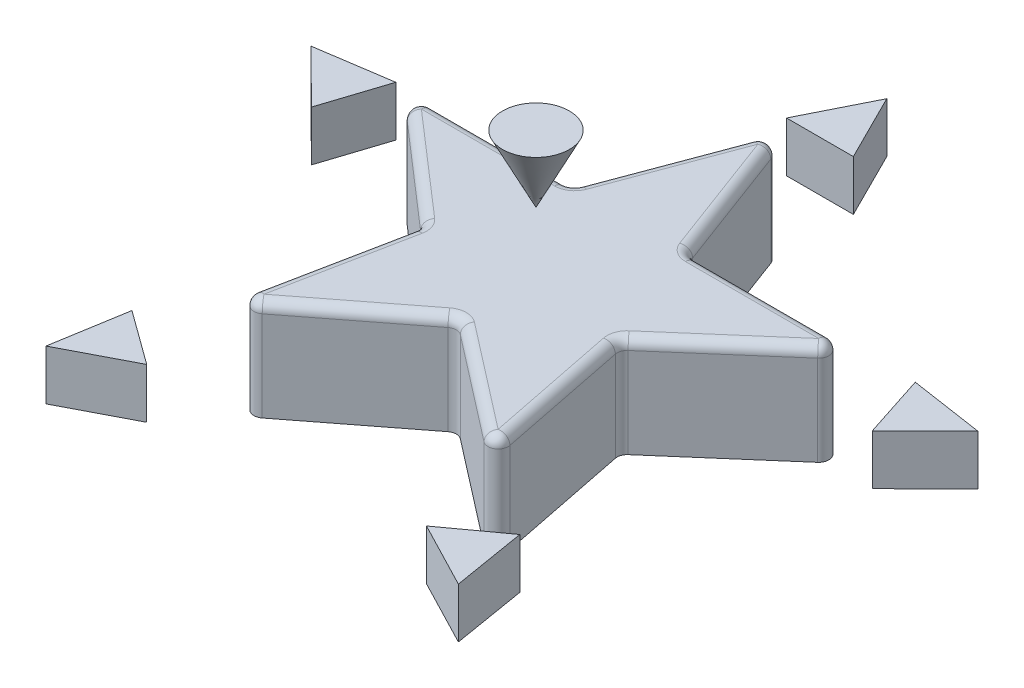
from build123d import *

# Parameters (mm, degrees)
STARBODY_DEPTH      = 15
FILLET1_R           = 3
BOSS_EXTRUDE4_DEPTH = 7.5
CIRPATTERN1_COUNT   = 5


with BuildPart() as part:
    # Sketch1 → StarBody (new, symmetric)
    with BuildSketch(Plane(origin=(0, 0, 0), x_dir=(1, 0, 0), z_dir=(0, 1, 0))):
        Polygon((0, 75), (-17.5, 28.162515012), (-67.5, 28.162515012), (-29.75, -4.62372448), (-39.548176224, -53.654283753), (0, -23.061118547), (39.548176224, -53.654283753), (29.75, -4.62372448), (67.5, 28.162515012), (17.5, 28.162515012), align=None)
    extrude(amount=STARBODY_DEPTH, both=True)

    # Fillet1
    fillet1_edges = [part.edges().sort_by_distance(p)[0] for p in [
        (-42.5, 15, -28.162515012),
        (-48.625, 15, -11.769395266),
        (-34.649088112, 15, 29.139004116),
        (17.5, 0, -28.162515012),
        (67.5, 0, -28.162515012),
        (29.75, 0, 4.62372448),
        (39.548176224, 0, 53.654283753),
        (0, 0, 23.061118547),
        (-39.548176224, 0, 53.654283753),
        (-29.75, 0, 4.62372448),
        (-67.5, 0, -28.162515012),
        (-17.5, 0, -28.162515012),
        (0, 0, -75),
        (-19.774088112, 15, 38.35770115),
        (19.774088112, 15, 38.35770115),
        (34.649088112, 15, 29.139004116),
        (48.625, 15, -11.769395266),
        (42.5, 15, -28.162515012),
        (8.75, 15, -51.581257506),
        (-8.75, 15, -51.581257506),
    ]]
    fillet(fillet1_edges, radius=FILLET1_R)


with BuildPart() as body_2:
    # Sketch3 → Revolve1 (revolve)
    with BuildSketch(Plane(origin=(0, 0, 0), x_dir=(0, 0, -1), z_dir=(1, 0, 0)), mode=Mode.PRIVATE) as revolve1_sk:
        Polygon((10, 51.837767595), (0, 31.837767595), (0, 51.837767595), align=None)
    revolve(revolve1_sk.sketch.rotate(Axis((0, 31.837767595, 0), (0, 1, 0)), 180), axis=Axis((0, 31.837767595, 0), (0, 1, 0)))


with BuildPart() as body_3:
    # Sketch5 → Boss-Extrude4 (new, symmetric)
    with BuildSketch(Plane(origin=(0, 0, 0), x_dir=(1, 0, 0), z_dir=(0, 1, 0))):
        Polygon((10, 85), (-10, 85), (0, 105), align=None)
    extrude(amount=BOSS_EXTRUDE4_DEPTH, both=True)


with BuildPart() as cirpattern1_1:
    # CirPattern1: pattern copy
    add(body_3.part.rotate(Axis((0, 0, 0), (0, 1, 0)), 1 * 360 / CIRPATTERN1_COUNT))


with BuildPart() as cirpattern1_2:
    # CirPattern1: pattern copy
    add(body_3.part.rotate(Axis((0, 0, 0), (0, 1, 0)), 2 * 360 / CIRPATTERN1_COUNT))


with BuildPart() as cirpattern1_3:
    # CirPattern1: pattern copy
    add(body_3.part.rotate(Axis((0, 0, 0), (0, 1, 0)), 3 * 360 / CIRPATTERN1_COUNT))


with BuildPart() as cirpattern1_4:
    # CirPattern1: pattern copy
    add(body_3.part.rotate(Axis((0, 0, 0), (0, 1, 0)), 4 * 360 / CIRPATTERN1_COUNT))


solid = Compound([part.part, body_2.part, body_3.part, cirpattern1_1.part, cirpattern1_2.part, cirpattern1_3.part, cirpattern1_4.part])
